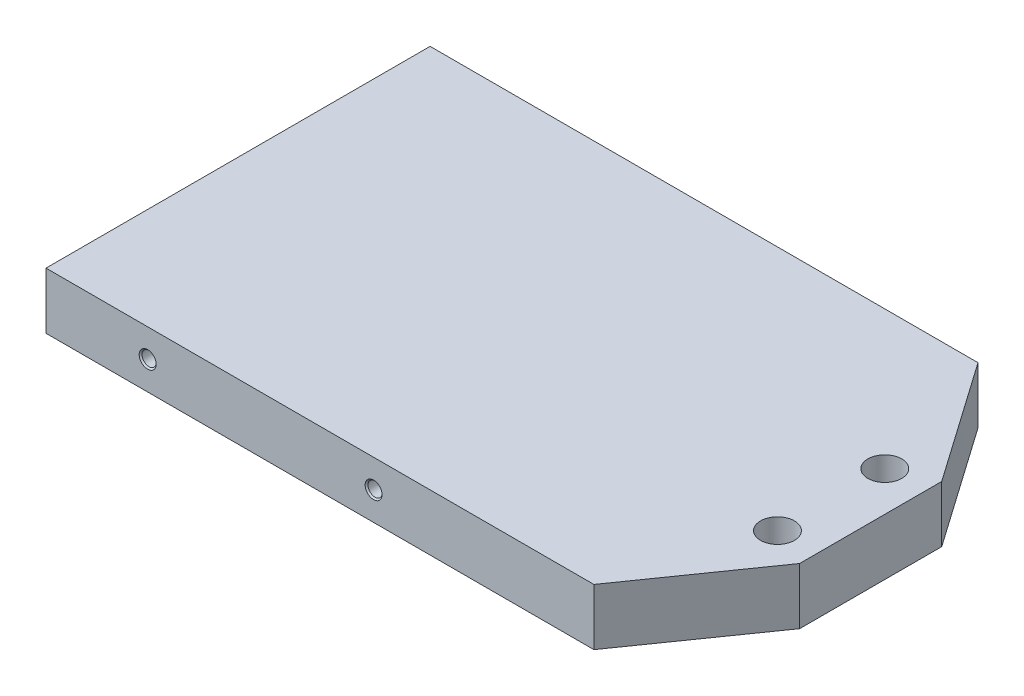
ISO-10303-21;
HEADER;
FILE_DESCRIPTION(('STEP AP214'),'2;1');
FILE_NAME('part.step','',(''),(''),'','','');
FILE_SCHEMA(('AUTOMOTIVE_DESIGN { 1 0 10303 214 1 1 1 1 }'));
ENDSEC;
DATA;
#1=APPLICATION_CONTEXT('core data for automotive mechanical design processes');
#2=APPLICATION_PROTOCOL_DEFINITION('international standard','automotive_design',2000,#1);
#3=PRODUCT_CONTEXT('',#1,'mechanical');
#4=PRODUCT('Part','Part','',(#3));
#5=PRODUCT_RELATED_PRODUCT_CATEGORY('part','',(#4));
#6=PRODUCT_DEFINITION_FORMATION('','',#4);
#7=PRODUCT_DEFINITION_CONTEXT('part definition',#1,'design');
#8=PRODUCT_DEFINITION('design','',#6,#7);
#9=PRODUCT_DEFINITION_SHAPE('','',#8);
#10=(LENGTH_UNIT() NAMED_UNIT(*) SI_UNIT(.MILLI.,.METRE.));
#11=(NAMED_UNIT(*) PLANE_ANGLE_UNIT() SI_UNIT($,.RADIAN.));
#12=(NAMED_UNIT(*) SI_UNIT($,.STERADIAN.) SOLID_ANGLE_UNIT());
#13=UNCERTAINTY_MEASURE_WITH_UNIT(LENGTH_MEASURE(1.E-05),#10,'distance_accuracy_value','');
#14=(GEOMETRIC_REPRESENTATION_CONTEXT(3) GLOBAL_UNCERTAINTY_ASSIGNED_CONTEXT((#13)) GLOBAL_UNIT_ASSIGNED_CONTEXT((#10,
#11,#12)) REPRESENTATION_CONTEXT('',''));
#15=CARTESIAN_POINT('',(0.,0.,0.));
#16=DIRECTION('',(0.,0.,1.));
#17=DIRECTION('',(1.,0.,0.));
#18=AXIS2_PLACEMENT_3D('',#15,#16,#17);
#19=CARTESIAN_POINT('',(0.,-5.,34.));
#20=DIRECTION('',(0.,1.,0.));
#21=DIRECTION('',(-1.,0.,0.));
#22=AXIS2_PLACEMENT_3D('',#19,#20,#21);
#23=PLANE('',#22);
#24=CARTESIAN_POINT('',(105.,-4.99999999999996,-9.5));
#25=DIRECTION('',(0.,-1.,0.));
#26=DIRECTION('',(0.,0.,-1.));
#27=AXIS2_PLACEMENT_3D('',#24,#25,#26);
#28=CIRCLE('',#27,6.00000000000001);
#29=CARTESIAN_POINT('',(105.,-4.99999999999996,-15.5));
#30=VERTEX_POINT('',#29);
#31=EDGE_CURVE('E197',#30,#30,#28,.T.);
#32=ORIENTED_EDGE('',*,*,#31,.F.);
#33=EDGE_LOOP('',(#32));
#34=FACE_BOUND('',#33,.T.);
#35=CARTESIAN_POINT('',(105.,-4.99999999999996,9.5));
#36=DIRECTION('',(0.,-1.,0.));
#37=DIRECTION('',(0.,0.,-1.));
#38=AXIS2_PLACEMENT_3D('',#35,#36,#37);
#39=CIRCLE('',#38,6.00000000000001);
#40=CARTESIAN_POINT('',(105.,-4.99999999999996,3.49999999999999));
#41=VERTEX_POINT('',#40);
#42=EDGE_CURVE('E182',#41,#41,#39,.T.);
#43=ORIENTED_EDGE('',*,*,#42,.F.);
#44=EDGE_LOOP('',(#43));
#45=FACE_BOUND('',#44,.T.);
#46=DIRECTION('',(0.57357643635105,0.,-0.819152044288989));
#47=VECTOR('',#46,1.);
#48=CARTESIAN_POINT('',(65.0879769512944,-4.99999999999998,79.5750921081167));
#49=LINE('',#48,#47);
#50=CARTESIAN_POINT('',(97.,-5.,34.));
#51=VERTEX_POINT('',#50);
#52=CARTESIAN_POINT('',(112.,-4.99999999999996,12.5777798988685));
#53=VERTEX_POINT('',#52);
#54=EDGE_CURVE('E158',#51,#53,#49,.T.);
#55=ORIENTED_EDGE('',*,*,#54,.F.);
#56=DIRECTION('',(1.,0.,0.));
#57=VECTOR('',#56,1.);
#58=CARTESIAN_POINT('',(0.,-5.,34.));
#59=LINE('',#58,#57);
#60=CARTESIAN_POINT('',(0.,-5.,34.));
#61=VERTEX_POINT('',#60);
#62=EDGE_CURVE('E247',#61,#51,#59,.T.);
#63=ORIENTED_EDGE('',*,*,#62,.F.);
#64=DIRECTION('',(0.,0.,-1.));
#65=VECTOR('',#64,1.);
#66=CARTESIAN_POINT('',(0.,-5.,34.));
#67=LINE('',#66,#65);
#68=CARTESIAN_POINT('',(0.,-5.,-34.));
#69=VERTEX_POINT('',#68);
#70=EDGE_CURVE('E258',#61,#69,#67,.T.);
#71=ORIENTED_EDGE('',*,*,#70,.T.);
#72=DIRECTION('',(1.,0.,0.));
#73=VECTOR('',#72,1.);
#74=CARTESIAN_POINT('',(0.,-5.,-34.));
#75=LINE('',#74,#73);
#76=CARTESIAN_POINT('',(97.,-4.99999999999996,-34.));
#77=VERTEX_POINT('',#76);
#78=EDGE_CURVE('E239',#69,#77,#75,.T.);
#79=ORIENTED_EDGE('',*,*,#78,.T.);
#80=DIRECTION('',(0.57357643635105,0.,0.819152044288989));
#81=VECTOR('',#80,1.);
#82=CARTESIAN_POINT('',(97.0375260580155,-4.99999999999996,-33.9464072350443));
#83=LINE('',#82,#81);
#84=CARTESIAN_POINT('',(112.,-4.99999999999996,-12.5777798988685));
#85=VERTEX_POINT('',#84);
#86=EDGE_CURVE('E167',#77,#85,#83,.T.);
#87=ORIENTED_EDGE('',*,*,#86,.T.);
#88=DIRECTION('',(0.,0.,-1.));
#89=VECTOR('',#88,1.);
#90=CARTESIAN_POINT('',(112.,-4.99999999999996,34.));
#91=LINE('',#90,#89);
#92=EDGE_CURVE('E256',#53,#85,#91,.T.);
#93=ORIENTED_EDGE('',*,*,#92,.F.);
#94=EDGE_LOOP('',(#55,#63,#71,#79,#87,#93));
#95=FACE_BOUND('',#94,.T.);
#96=ADVANCED_FACE('F35',(#34,#45,#95),#23,.F.);
#97=CARTESIAN_POINT('',(112.,-4.99999999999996,34.));
#98=DIRECTION('',(-1.,0.,0.));
#99=DIRECTION('',(0.,0.,1.));
#100=AXIS2_PLACEMENT_3D('',#97,#98,#99);
#101=PLANE('',#100);
#102=DIRECTION('',(0.,1.,0.));
#103=VECTOR('',#102,1.);
#104=CARTESIAN_POINT('',(112.,-169.259702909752,12.5777798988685));
#105=LINE('',#104,#103);
#106=CARTESIAN_POINT('',(112.,5.,12.5777798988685));
#107=VERTEX_POINT('',#106);
#108=EDGE_CURVE('E50',#53,#107,#105,.T.);
#109=ORIENTED_EDGE('',*,*,#108,.F.);
#110=ORIENTED_EDGE('',*,*,#92,.T.);
#111=DIRECTION('',(0.,1.,0.));
#112=VECTOR('',#111,1.);
#113=CARTESIAN_POINT('',(112.,-169.259702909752,-12.5777798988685));
#114=LINE('',#113,#112);
#115=CARTESIAN_POINT('',(112.,5.,-12.5777798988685));
#116=VERTEX_POINT('',#115);
#117=EDGE_CURVE('E161',#85,#116,#114,.T.);
#118=ORIENTED_EDGE('',*,*,#117,.T.);
#119=DIRECTION('',(0.,0.,-1.));
#120=VECTOR('',#119,1.);
#121=CARTESIAN_POINT('',(112.,5.,34.));
#122=LINE('',#121,#120);
#123=EDGE_CURVE('E254',#107,#116,#122,.T.);
#124=ORIENTED_EDGE('',*,*,#123,.F.);
#125=EDGE_LOOP('',(#109,#110,#118,#124));
#126=FACE_BOUND('',#125,.T.);
#127=ADVANCED_FACE('F276',(#126),#101,.F.);
#128=CARTESIAN_POINT('',(0.,5.,34.));
#129=DIRECTION('',(0.,-1.,0.));
#130=DIRECTION('',(0.,0.,-1.));
#131=AXIS2_PLACEMENT_3D('',#128,#129,#130);
#132=PLANE('',#131);
#133=CARTESIAN_POINT('',(105.,5.00000000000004,-9.5));
#134=DIRECTION('',(0.,-1.,0.));
#135=DIRECTION('',(0.,0.,-1.));
#136=AXIS2_PLACEMENT_3D('',#133,#134,#135);
#137=CIRCLE('',#136,3.);
#138=CARTESIAN_POINT('',(105.,5.00000000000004,-12.5));
#139=VERTEX_POINT('',#138);
#140=EDGE_CURVE('E185',#139,#139,#137,.T.);
#141=ORIENTED_EDGE('',*,*,#140,.T.);
#142=EDGE_LOOP('',(#141));
#143=FACE_BOUND('',#142,.T.);
#144=CARTESIAN_POINT('',(105.,5.00000000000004,9.5));
#145=DIRECTION('',(0.,-1.,0.));
#146=DIRECTION('',(0.,0.,-1.));
#147=AXIS2_PLACEMENT_3D('',#144,#145,#146);
#148=CIRCLE('',#147,3.);
#149=CARTESIAN_POINT('',(105.,5.00000000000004,6.5));
#150=VERTEX_POINT('',#149);
#151=EDGE_CURVE('E170',#150,#150,#148,.T.);
#152=ORIENTED_EDGE('',*,*,#151,.T.);
#153=EDGE_LOOP('',(#152));
#154=FACE_BOUND('',#153,.T.);
#155=DIRECTION('',(-0.57357643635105,0.,0.819152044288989));
#156=VECTOR('',#155,1.);
#157=CARTESIAN_POINT('',(65.0879769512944,5.,79.5750921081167));
#158=LINE('',#157,#156);
#159=CARTESIAN_POINT('',(97.,5.,34.));
#160=VERTEX_POINT('',#159);
#161=EDGE_CURVE('E58',#107,#160,#158,.T.);
#162=ORIENTED_EDGE('',*,*,#161,.F.);
#163=ORIENTED_EDGE('',*,*,#123,.T.);
#164=DIRECTION('',(-0.57357643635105,0.,-0.819152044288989));
#165=VECTOR('',#164,1.);
#166=CARTESIAN_POINT('',(97.0375260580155,5.,-33.9464072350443));
#167=LINE('',#166,#165);
#168=CARTESIAN_POINT('',(97.,5.,-34.));
#169=VERTEX_POINT('',#168);
#170=EDGE_CURVE('E164',#116,#169,#167,.T.);
#171=ORIENTED_EDGE('',*,*,#170,.T.);
#172=DIRECTION('',(-1.,0.,0.));
#173=VECTOR('',#172,1.);
#174=CARTESIAN_POINT('',(0.,5.,-34.));
#175=LINE('',#174,#173);
#176=CARTESIAN_POINT('',(0.,5.,-34.));
#177=VERTEX_POINT('',#176);
#178=EDGE_CURVE('E242',#169,#177,#175,.T.);
#179=ORIENTED_EDGE('',*,*,#178,.T.);
#180=DIRECTION('',(0.,0.,-1.));
#181=VECTOR('',#180,1.);
#182=CARTESIAN_POINT('',(0.,5.,34.));
#183=LINE('',#182,#181);
#184=CARTESIAN_POINT('',(0.,5.,34.));
#185=VERTEX_POINT('',#184);
#186=EDGE_CURVE('E251',#185,#177,#183,.T.);
#187=ORIENTED_EDGE('',*,*,#186,.F.);
#188=DIRECTION('',(-1.,0.,0.));
#189=VECTOR('',#188,1.);
#190=CARTESIAN_POINT('',(0.,5.,34.));
#191=LINE('',#190,#189);
#192=EDGE_CURVE('E249',#160,#185,#191,.T.);
#193=ORIENTED_EDGE('',*,*,#192,.F.);
#194=EDGE_LOOP('',(#162,#163,#171,#179,#187,#193));
#195=FACE_BOUND('',#194,.T.);
#196=ADVANCED_FACE('F275',(#143,#154,#195),#132,.F.);
#197=CARTESIAN_POINT('',(0.,5.,34.));
#198=DIRECTION('',(0.,0.,-1.));
#199=DIRECTION('',(-1.,0.,0.));
#200=AXIS2_PLACEMENT_3D('',#197,#198,#199);
#201=PLANE('',#200);
#202=CARTESIAN_POINT('',(58.,0.,34.));
#203=DIRECTION('',(0.,0.,1.));
#204=DIRECTION('',(1.,0.,0.));
#205=AXIS2_PLACEMENT_3D('',#202,#203,#204);
#206=CIRCLE('',#205,1.5);
#207=CARTESIAN_POINT('',(59.5,0.,34.));
#208=VERTEX_POINT('',#207);
#209=EDGE_CURVE('E138',#208,#208,#206,.T.);
#210=ORIENTED_EDGE('',*,*,#209,.F.);
#211=EDGE_LOOP('',(#210));
#212=FACE_BOUND('',#211,.T.);
#213=CARTESIAN_POINT('',(18.,0.,34.));
#214=DIRECTION('',(0.,0.,1.));
#215=DIRECTION('',(1.,0.,0.));
#216=AXIS2_PLACEMENT_3D('',#213,#214,#215);
#217=CIRCLE('',#216,1.5);
#218=CARTESIAN_POINT('',(19.5,0.,34.));
#219=VERTEX_POINT('',#218);
#220=EDGE_CURVE('E153',#219,#219,#217,.T.);
#221=ORIENTED_EDGE('',*,*,#220,.F.);
#222=EDGE_LOOP('',(#221));
#223=FACE_BOUND('',#222,.T.);
#224=DIRECTION('',(0.,-1.,0.));
#225=VECTOR('',#224,1.);
#226=CARTESIAN_POINT('',(97.,5.00000000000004,34.));
#227=LINE('',#226,#225);
#228=EDGE_CURVE('E11',#160,#51,#227,.T.);
#229=ORIENTED_EDGE('',*,*,#228,.F.);
#230=ORIENTED_EDGE('',*,*,#192,.T.);
#231=DIRECTION('',(0.,-1.,0.));
#232=VECTOR('',#231,1.);
#233=CARTESIAN_POINT('',(0.,-5.,34.));
#234=LINE('',#233,#232);
#235=EDGE_CURVE('E244',#185,#61,#234,.T.);
#236=ORIENTED_EDGE('',*,*,#235,.T.);
#237=ORIENTED_EDGE('',*,*,#62,.T.);
#238=EDGE_LOOP('',(#229,#230,#236,#237));
#239=FACE_BOUND('',#238,.T.);
#240=ADVANCED_FACE('F280',(#212,#223,#239),#201,.F.);
#241=CARTESIAN_POINT('',(0.,-5.,34.));
#242=DIRECTION('',(1.,0.,0.));
#243=DIRECTION('',(0.,1.,0.));
#244=AXIS2_PLACEMENT_3D('',#241,#242,#243);
#245=PLANE('',#244);
#246=CARTESIAN_POINT('',(0.,0.,22.5));
#247=DIRECTION('',(-1.,0.,0.));
#248=DIRECTION('',(0.,0.,1.));
#249=AXIS2_PLACEMENT_3D('',#246,#247,#248);
#250=CIRCLE('',#249,3.);
#251=CARTESIAN_POINT('',(0.,0.,25.5));
#252=VERTEX_POINT('',#251);
#253=EDGE_CURVE('E200',#252,#252,#250,.T.);
#254=ORIENTED_EDGE('',*,*,#253,.F.);
#255=EDGE_LOOP('',(#254));
#256=FACE_BOUND('',#255,.T.);
#257=CARTESIAN_POINT('',(0.,0.,-22.5));
#258=DIRECTION('',(-1.,0.,0.));
#259=DIRECTION('',(0.,0.,1.));
#260=AXIS2_PLACEMENT_3D('',#257,#258,#259);
#261=CIRCLE('',#260,3.);
#262=CARTESIAN_POINT('',(0.,0.,-19.5));
#263=VERTEX_POINT('',#262);
#264=EDGE_CURVE('E215',#263,#263,#261,.T.);
#265=ORIENTED_EDGE('',*,*,#264,.F.);
#266=EDGE_LOOP('',(#265));
#267=FACE_BOUND('',#266,.T.);
#268=CARTESIAN_POINT('',(0.,0.,29.));
#269=DIRECTION('',(-1.,0.,0.));
#270=DIRECTION('',(0.,0.,1.));
#271=AXIS2_PLACEMENT_3D('',#268,#269,#270);
#272=CIRCLE('',#271,2.5);
#273=CARTESIAN_POINT('',(0.,0.,31.5));
#274=VERTEX_POINT('',#273);
#275=EDGE_CURVE('E218',#274,#274,#272,.T.);
#276=ORIENTED_EDGE('',*,*,#275,.F.);
#277=EDGE_LOOP('',(#276));
#278=FACE_BOUND('',#277,.T.);
#279=CARTESIAN_POINT('',(0.,0.,-29.));
#280=DIRECTION('',(-1.,0.,0.));
#281=DIRECTION('',(0.,0.,1.));
#282=AXIS2_PLACEMENT_3D('',#279,#280,#281);
#283=CIRCLE('',#282,2.5);
#284=CARTESIAN_POINT('',(0.,0.,-26.5));
#285=VERTEX_POINT('',#284);
#286=EDGE_CURVE('E233',#285,#285,#283,.T.);
#287=ORIENTED_EDGE('',*,*,#286,.F.);
#288=EDGE_LOOP('',(#287));
#289=FACE_BOUND('',#288,.T.);
#290=DIRECTION('',(0.,-1.,0.));
#291=VECTOR('',#290,1.);
#292=CARTESIAN_POINT('',(0.,-5.,-34.));
#293=LINE('',#292,#291);
#294=EDGE_CURVE('E236',#177,#69,#293,.T.);
#295=ORIENTED_EDGE('',*,*,#294,.T.);
#296=ORIENTED_EDGE('',*,*,#70,.F.);
#297=ORIENTED_EDGE('',*,*,#235,.F.);
#298=ORIENTED_EDGE('',*,*,#186,.T.);
#299=EDGE_LOOP('',(#295,#296,#297,#298));
#300=FACE_BOUND('',#299,.T.);
#301=ADVANCED_FACE('F37',(#256,#267,#278,#289,#300),#245,.F.);
#302=CARTESIAN_POINT('',(0.,5.,-34.));
#303=DIRECTION('',(0.,0.,-1.));
#304=DIRECTION('',(-1.,0.,0.));
#305=AXIS2_PLACEMENT_3D('',#302,#303,#304);
#306=PLANE('',#305);
#307=CARTESIAN_POINT('',(58.,0.,-34.));
#308=DIRECTION('',(0.,0.,-1.));
#309=DIRECTION('',(-1.,0.,0.));
#310=AXIS2_PLACEMENT_3D('',#307,#308,#309);
#311=CIRCLE('',#310,1.5);
#312=CARTESIAN_POINT('',(56.5,0.,-34.));
#313=VERTEX_POINT('',#312);
#314=EDGE_CURVE('E122',#313,#313,#311,.T.);
#315=ORIENTED_EDGE('',*,*,#314,.F.);
#316=EDGE_LOOP('',(#315));
#317=FACE_BOUND('',#316,.T.);
#318=CARTESIAN_POINT('',(18.,0.,-34.));
#319=DIRECTION('',(0.,0.,-1.));
#320=DIRECTION('',(-1.,0.,0.));
#321=AXIS2_PLACEMENT_3D('',#318,#319,#320);
#322=CIRCLE('',#321,1.5);
#323=CARTESIAN_POINT('',(16.5,0.,-34.));
#324=VERTEX_POINT('',#323);
#325=EDGE_CURVE('E135',#324,#324,#322,.T.);
#326=ORIENTED_EDGE('',*,*,#325,.F.);
#327=EDGE_LOOP('',(#326));
#328=FACE_BOUND('',#327,.T.);
#329=DIRECTION('',(0.,1.,0.));
#330=VECTOR('',#329,1.);
#331=CARTESIAN_POINT('',(97.,5.00000000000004,-34.));
#332=LINE('',#331,#330);
#333=EDGE_CURVE('E43',#77,#169,#332,.T.);
#334=ORIENTED_EDGE('',*,*,#333,.F.);
#335=ORIENTED_EDGE('',*,*,#78,.F.);
#336=ORIENTED_EDGE('',*,*,#294,.F.);
#337=ORIENTED_EDGE('',*,*,#178,.F.);
#338=EDGE_LOOP('',(#334,#335,#336,#337));
#339=FACE_BOUND('',#338,.T.);
#340=ADVANCED_FACE('F267',(#317,#328,#339),#306,.T.);
#341=CARTESIAN_POINT('',(0.,0.,-29.));
#342=DIRECTION('',(-1.,0.,0.));
#343=DIRECTION('',(0.,0.,1.));
#344=AXIS2_PLACEMENT_3D('',#341,#342,#343);
#345=CONICAL_SURFACE('',#344,2.5,0.785398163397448);
#346=CARTESIAN_POINT('',(0.400000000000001,0.,-29.));
#347=DIRECTION('',(-1.,0.,0.));
#348=DIRECTION('',(0.,0.,1.));
#349=AXIS2_PLACEMENT_3D('',#346,#347,#348);
#350=CIRCLE('',#349,2.1);
#351=CARTESIAN_POINT('',(0.400000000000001,0.,-26.9));
#352=VERTEX_POINT('',#351);
#353=EDGE_CURVE('E230',#352,#352,#350,.T.);
#354=ORIENTED_EDGE('',*,*,#353,.F.);
#355=EDGE_LOOP('',(#354));
#356=FACE_BOUND('',#355,.T.);
#357=ORIENTED_EDGE('',*,*,#286,.T.);
#358=EDGE_LOOP('',(#357));
#359=FACE_BOUND('',#358,.T.);
#360=ADVANCED_FACE('F377',(#356,#359),#345,.F.);
#361=CARTESIAN_POINT('',(0.,0.,-29.));
#362=DIRECTION('',(-1.,0.,0.));
#363=DIRECTION('',(0.,0.,1.));
#364=AXIS2_PLACEMENT_3D('',#361,#362,#363);
#365=CYLINDRICAL_SURFACE('',#364,2.1);
#366=CARTESIAN_POINT('',(15.,0.,-29.));
#367=DIRECTION('',(-1.,0.,0.));
#368=DIRECTION('',(0.,0.,1.));
#369=AXIS2_PLACEMENT_3D('',#366,#367,#368);
#370=CIRCLE('',#369,2.1);
#371=CARTESIAN_POINT('',(15.,0.,-26.9));
#372=VERTEX_POINT('',#371);
#373=EDGE_CURVE('E227',#372,#372,#370,.T.);
#374=ORIENTED_EDGE('',*,*,#373,.F.);
#375=EDGE_LOOP('',(#374));
#376=FACE_BOUND('',#375,.T.);
#377=ORIENTED_EDGE('',*,*,#353,.T.);
#378=EDGE_LOOP('',(#377));
#379=FACE_BOUND('',#378,.T.);
#380=ADVANCED_FACE('F373',(#376,#379),#365,.F.);
#381=CARTESIAN_POINT('',(15.,0.,-29.));
#382=DIRECTION('',(-1.,0.,0.));
#383=DIRECTION('',(0.,0.,1.));
#384=AXIS2_PLACEMENT_3D('',#381,#382,#383);
#385=CONICAL_SURFACE('',#384,2.1,1.02974425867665);
#386=CARTESIAN_POINT('',(16.2618072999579,0.,-29.));
#387=VERTEX_POINT('',#386);
#388=VERTEX_LOOP('',#387);
#389=FACE_BOUND('',#388,.T.);
#390=ORIENTED_EDGE('',*,*,#373,.T.);
#391=EDGE_LOOP('',(#390));
#392=FACE_BOUND('',#391,.T.);
#393=ADVANCED_FACE('F364',(#389,#392),#385,.F.);
#394=CARTESIAN_POINT('',(0.,0.,29.));
#395=DIRECTION('',(-1.,0.,0.));
#396=DIRECTION('',(0.,0.,1.));
#397=AXIS2_PLACEMENT_3D('',#394,#395,#396);
#398=CONICAL_SURFACE('',#397,2.5,0.785398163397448);
#399=CARTESIAN_POINT('',(0.400000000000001,0.,29.));
#400=DIRECTION('',(-1.,0.,0.));
#401=DIRECTION('',(0.,0.,1.));
#402=AXIS2_PLACEMENT_3D('',#399,#400,#401);
#403=CIRCLE('',#402,2.1);
#404=CARTESIAN_POINT('',(0.400000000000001,0.,31.1));
#405=VERTEX_POINT('',#404);
#406=EDGE_CURVE('E224',#405,#405,#403,.T.);
#407=ORIENTED_EDGE('',*,*,#406,.F.);
#408=EDGE_LOOP('',(#407));
#409=FACE_BOUND('',#408,.T.);
#410=ORIENTED_EDGE('',*,*,#275,.T.);
#411=EDGE_LOOP('',(#410));
#412=FACE_BOUND('',#411,.T.);
#413=ADVANCED_FACE('F359',(#409,#412),#398,.F.);
#414=CARTESIAN_POINT('',(0.,0.,29.));
#415=DIRECTION('',(-1.,0.,0.));
#416=DIRECTION('',(0.,0.,1.));
#417=AXIS2_PLACEMENT_3D('',#414,#415,#416);
#418=CYLINDRICAL_SURFACE('',#417,2.1);
#419=CARTESIAN_POINT('',(15.,0.,29.));
#420=DIRECTION('',(-1.,0.,0.));
#421=DIRECTION('',(0.,0.,1.));
#422=AXIS2_PLACEMENT_3D('',#419,#420,#421);
#423=CIRCLE('',#422,2.1);
#424=CARTESIAN_POINT('',(15.,0.,31.1));
#425=VERTEX_POINT('',#424);
#426=EDGE_CURVE('E221',#425,#425,#423,.T.);
#427=ORIENTED_EDGE('',*,*,#426,.F.);
#428=EDGE_LOOP('',(#427));
#429=FACE_BOUND('',#428,.T.);
#430=ORIENTED_EDGE('',*,*,#406,.T.);
#431=EDGE_LOOP('',(#430));
#432=FACE_BOUND('',#431,.T.);
#433=ADVANCED_FACE('F362',(#429,#432),#418,.F.);
#434=CARTESIAN_POINT('',(15.,0.,29.));
#435=DIRECTION('',(-1.,0.,0.));
#436=DIRECTION('',(0.,0.,1.));
#437=AXIS2_PLACEMENT_3D('',#434,#435,#436);
#438=CONICAL_SURFACE('',#437,2.1,1.02974425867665);
#439=CARTESIAN_POINT('',(16.2618072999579,0.,29.));
#440=VERTEX_POINT('',#439);
#441=VERTEX_LOOP('',#440);
#442=FACE_BOUND('',#441,.T.);
#443=ORIENTED_EDGE('',*,*,#426,.T.);
#444=EDGE_LOOP('',(#443));
#445=FACE_BOUND('',#444,.T.);
#446=ADVANCED_FACE('F357',(#442,#445),#438,.F.);
#447=CARTESIAN_POINT('',(0.,0.,-22.5));
#448=DIRECTION('',(-1.,0.,0.));
#449=DIRECTION('',(0.,0.,1.));
#450=AXIS2_PLACEMENT_3D('',#447,#448,#449);
#451=CONICAL_SURFACE('',#450,3.,0.785398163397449);
#452=CARTESIAN_POINT('',(0.5,0.,-22.5));
#453=DIRECTION('',(-1.,0.,0.));
#454=DIRECTION('',(0.,0.,1.));
#455=AXIS2_PLACEMENT_3D('',#452,#453,#454);
#456=CIRCLE('',#455,2.5);
#457=CARTESIAN_POINT('',(0.5,0.,-20.));
#458=VERTEX_POINT('',#457);
#459=EDGE_CURVE('E212',#458,#458,#456,.T.);
#460=ORIENTED_EDGE('',*,*,#459,.F.);
#461=EDGE_LOOP('',(#460));
#462=FACE_BOUND('',#461,.T.);
#463=ORIENTED_EDGE('',*,*,#264,.T.);
#464=EDGE_LOOP('',(#463));
#465=FACE_BOUND('',#464,.T.);
#466=ADVANCED_FACE('F353',(#462,#465),#451,.F.);
#467=CARTESIAN_POINT('',(0.,0.,-22.5));
#468=DIRECTION('',(-1.,0.,0.));
#469=DIRECTION('',(0.,0.,1.));
#470=AXIS2_PLACEMENT_3D('',#467,#468,#469);
#471=CYLINDRICAL_SURFACE('',#470,2.5);
#472=CARTESIAN_POINT('',(12.,0.,-22.5));
#473=DIRECTION('',(-1.,0.,0.));
#474=DIRECTION('',(0.,0.,1.));
#475=AXIS2_PLACEMENT_3D('',#472,#473,#474);
#476=CIRCLE('',#475,2.5);
#477=CARTESIAN_POINT('',(12.,0.,-20.));
#478=VERTEX_POINT('',#477);
#479=EDGE_CURVE('E209',#478,#478,#476,.T.);
#480=ORIENTED_EDGE('',*,*,#479,.F.);
#481=EDGE_LOOP('',(#480));
#482=FACE_BOUND('',#481,.T.);
#483=ORIENTED_EDGE('',*,*,#459,.T.);
#484=EDGE_LOOP('',(#483));
#485=FACE_BOUND('',#484,.T.);
#486=ADVANCED_FACE('F349',(#482,#485),#471,.F.);
#487=CARTESIAN_POINT('',(12.,0.,-22.5));
#488=DIRECTION('',(-1.,0.,0.));
#489=DIRECTION('',(0.,0.,1.));
#490=AXIS2_PLACEMENT_3D('',#487,#488,#489);
#491=CONICAL_SURFACE('',#490,2.5,1.02974425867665);
#492=CARTESIAN_POINT('',(13.5021515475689,0.,-22.5));
#493=VERTEX_POINT('',#492);
#494=VERTEX_LOOP('',#493);
#495=FACE_BOUND('',#494,.T.);
#496=ORIENTED_EDGE('',*,*,#479,.T.);
#497=EDGE_LOOP('',(#496));
#498=FACE_BOUND('',#497,.T.);
#499=ADVANCED_FACE('F340',(#495,#498),#491,.F.);
#500=CARTESIAN_POINT('',(0.,0.,22.5));
#501=DIRECTION('',(-1.,0.,0.));
#502=DIRECTION('',(0.,0.,1.));
#503=AXIS2_PLACEMENT_3D('',#500,#501,#502);
#504=CONICAL_SURFACE('',#503,3.,0.785398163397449);
#505=CARTESIAN_POINT('',(0.5,0.,22.5));
#506=DIRECTION('',(-1.,0.,0.));
#507=DIRECTION('',(0.,0.,1.));
#508=AXIS2_PLACEMENT_3D('',#505,#506,#507);
#509=CIRCLE('',#508,2.5);
#510=CARTESIAN_POINT('',(0.5,0.,25.));
#511=VERTEX_POINT('',#510);
#512=EDGE_CURVE('E206',#511,#511,#509,.T.);
#513=ORIENTED_EDGE('',*,*,#512,.F.);
#514=EDGE_LOOP('',(#513));
#515=FACE_BOUND('',#514,.T.);
#516=ORIENTED_EDGE('',*,*,#253,.T.);
#517=EDGE_LOOP('',(#516));
#518=FACE_BOUND('',#517,.T.);
#519=ADVANCED_FACE('F335',(#515,#518),#504,.F.);
#520=CARTESIAN_POINT('',(0.,0.,22.5));
#521=DIRECTION('',(-1.,0.,0.));
#522=DIRECTION('',(0.,0.,1.));
#523=AXIS2_PLACEMENT_3D('',#520,#521,#522);
#524=CYLINDRICAL_SURFACE('',#523,2.5);
#525=CARTESIAN_POINT('',(12.,0.,22.5));
#526=DIRECTION('',(-1.,0.,0.));
#527=DIRECTION('',(0.,0.,1.));
#528=AXIS2_PLACEMENT_3D('',#525,#526,#527);
#529=CIRCLE('',#528,2.5);
#530=CARTESIAN_POINT('',(12.,0.,25.));
#531=VERTEX_POINT('',#530);
#532=EDGE_CURVE('E203',#531,#531,#529,.T.);
#533=ORIENTED_EDGE('',*,*,#532,.F.);
#534=EDGE_LOOP('',(#533));
#535=FACE_BOUND('',#534,.T.);
#536=ORIENTED_EDGE('',*,*,#512,.T.);
#537=EDGE_LOOP('',(#536));
#538=FACE_BOUND('',#537,.T.);
#539=ADVANCED_FACE('F338',(#535,#538),#524,.F.);
#540=CARTESIAN_POINT('',(12.,0.,22.5));
#541=DIRECTION('',(-1.,0.,0.));
#542=DIRECTION('',(0.,0.,1.));
#543=AXIS2_PLACEMENT_3D('',#540,#541,#542);
#544=CONICAL_SURFACE('',#543,2.5,1.02974425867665);
#545=CARTESIAN_POINT('',(13.5021515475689,0.,22.5));
#546=VERTEX_POINT('',#545);
#547=VERTEX_LOOP('',#546);
#548=FACE_BOUND('',#547,.T.);
#549=ORIENTED_EDGE('',*,*,#532,.T.);
#550=EDGE_LOOP('',(#549));
#551=FACE_BOUND('',#550,.T.);
#552=ADVANCED_FACE('F333',(#548,#551),#544,.F.);
#553=CARTESIAN_POINT('',(105.,-4.99999999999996,-9.5));
#554=DIRECTION('',(0.,-1.,0.));
#555=DIRECTION('',(0.,0.,-1.));
#556=AXIS2_PLACEMENT_3D('',#553,#554,#555);
#557=CONICAL_SURFACE('',#556,6.00000000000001,0.78539816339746);
#558=CARTESIAN_POINT('',(105.,-4.49999999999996,-9.5));
#559=DIRECTION('',(0.,-1.,0.));
#560=DIRECTION('',(0.,0.,-1.));
#561=AXIS2_PLACEMENT_3D('',#558,#559,#560);
#562=CIRCLE('',#561,5.49999999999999);
#563=CARTESIAN_POINT('',(105.,-4.49999999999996,-15.));
#564=VERTEX_POINT('',#563);
#565=EDGE_CURVE('E194',#564,#564,#562,.T.);
#566=ORIENTED_EDGE('',*,*,#565,.F.);
#567=EDGE_LOOP('',(#566));
#568=FACE_BOUND('',#567,.T.);
#569=ORIENTED_EDGE('',*,*,#31,.T.);
#570=EDGE_LOOP('',(#569));
#571=FACE_BOUND('',#570,.T.);
#572=ADVANCED_FACE('F329',(#568,#571),#557,.F.);
#573=CARTESIAN_POINT('',(105.,-4.99999999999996,-9.5));
#574=DIRECTION('',(0.,-1.,0.));
#575=DIRECTION('',(0.,0.,-1.));
#576=AXIS2_PLACEMENT_3D('',#573,#574,#575);
#577=CYLINDRICAL_SURFACE('',#576,5.5);
#578=CARTESIAN_POINT('',(105.,0.200000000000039,-9.5));
#579=DIRECTION('',(0.,-1.,0.));
#580=DIRECTION('',(0.,0.,-1.));
#581=AXIS2_PLACEMENT_3D('',#578,#579,#580);
#582=CIRCLE('',#581,5.50000000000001);
#583=CARTESIAN_POINT('',(105.,0.200000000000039,-15.));
#584=VERTEX_POINT('',#583);
#585=EDGE_CURVE('E191',#584,#584,#582,.T.);
#586=ORIENTED_EDGE('',*,*,#585,.F.);
#587=EDGE_LOOP('',(#586));
#588=FACE_BOUND('',#587,.T.);
#589=ORIENTED_EDGE('',*,*,#565,.T.);
#590=EDGE_LOOP('',(#589));
#591=FACE_BOUND('',#590,.T.);
#592=ADVANCED_FACE('F325',(#588,#591),#577,.F.);
#593=CARTESIAN_POINT('',(110.5,0.200000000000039,-9.5));
#594=DIRECTION('',(0.,1.,0.));
#595=DIRECTION('',(0.,0.,1.));
#596=AXIS2_PLACEMENT_3D('',#593,#594,#595);
#597=PLANE('',#596);
#598=CARTESIAN_POINT('',(105.,0.200000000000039,-9.5));
#599=DIRECTION('',(0.,-1.,0.));
#600=DIRECTION('',(0.,0.,-1.));
#601=AXIS2_PLACEMENT_3D('',#598,#599,#600);
#602=CIRCLE('',#601,3.);
#603=CARTESIAN_POINT('',(105.,0.200000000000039,-12.5));
#604=VERTEX_POINT('',#603);
#605=EDGE_CURVE('E188',#604,#604,#602,.T.);
#606=ORIENTED_EDGE('',*,*,#605,.F.);
#607=EDGE_LOOP('',(#606));
#608=FACE_BOUND('',#607,.T.);
#609=ORIENTED_EDGE('',*,*,#585,.T.);
#610=EDGE_LOOP('',(#609));
#611=FACE_BOUND('',#610,.T.);
#612=ADVANCED_FACE('F317',(#608,#611),#597,.F.);
#613=CARTESIAN_POINT('',(105.,-4.99999999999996,-9.5));
#614=DIRECTION('',(0.,-1.,0.));
#615=DIRECTION('',(0.,0.,-1.));
#616=AXIS2_PLACEMENT_3D('',#613,#614,#615);
#617=CYLINDRICAL_SURFACE('',#616,3.);
#618=ORIENTED_EDGE('',*,*,#140,.F.);
#619=EDGE_LOOP('',(#618));
#620=FACE_BOUND('',#619,.T.);
#621=ORIENTED_EDGE('',*,*,#605,.T.);
#622=EDGE_LOOP('',(#621));
#623=FACE_BOUND('',#622,.T.);
#624=ADVANCED_FACE('F307',(#620,#623),#617,.F.);
#625=CARTESIAN_POINT('',(105.,-4.99999999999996,9.5));
#626=DIRECTION('',(0.,-1.,0.));
#627=DIRECTION('',(0.,0.,-1.));
#628=AXIS2_PLACEMENT_3D('',#625,#626,#627);
#629=CONICAL_SURFACE('',#628,6.00000000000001,0.78539816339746);
#630=CARTESIAN_POINT('',(105.,-4.49999999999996,9.5));
#631=DIRECTION('',(0.,-1.,0.));
#632=DIRECTION('',(0.,0.,-1.));
#633=AXIS2_PLACEMENT_3D('',#630,#631,#632);
#634=CIRCLE('',#633,5.49999999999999);
#635=CARTESIAN_POINT('',(105.,-4.49999999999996,4.00000000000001));
#636=VERTEX_POINT('',#635);
#637=EDGE_CURVE('E179',#636,#636,#634,.T.);
#638=ORIENTED_EDGE('',*,*,#637,.F.);
#639=EDGE_LOOP('',(#638));
#640=FACE_BOUND('',#639,.T.);
#641=ORIENTED_EDGE('',*,*,#42,.T.);
#642=EDGE_LOOP('',(#641));
#643=FACE_BOUND('',#642,.T.);
#644=ADVANCED_FACE('F304',(#640,#643),#629,.F.);
#645=CARTESIAN_POINT('',(105.,-4.99999999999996,9.5));
#646=DIRECTION('',(0.,-1.,0.));
#647=DIRECTION('',(0.,0.,-1.));
#648=AXIS2_PLACEMENT_3D('',#645,#646,#647);
#649=CYLINDRICAL_SURFACE('',#648,5.5);
#650=CARTESIAN_POINT('',(105.,0.200000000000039,9.5));
#651=DIRECTION('',(0.,-1.,0.));
#652=DIRECTION('',(0.,0.,-1.));
#653=AXIS2_PLACEMENT_3D('',#650,#651,#652);
#654=CIRCLE('',#653,5.50000000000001);
#655=CARTESIAN_POINT('',(105.,0.200000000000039,3.99999999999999));
#656=VERTEX_POINT('',#655);
#657=EDGE_CURVE('E176',#656,#656,#654,.T.);
#658=ORIENTED_EDGE('',*,*,#657,.F.);
#659=EDGE_LOOP('',(#658));
#660=FACE_BOUND('',#659,.T.);
#661=ORIENTED_EDGE('',*,*,#637,.T.);
#662=EDGE_LOOP('',(#661));
#663=FACE_BOUND('',#662,.T.);
#664=ADVANCED_FACE('F306',(#660,#663),#649,.F.);
#665=CARTESIAN_POINT('',(110.5,0.200000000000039,9.5));
#666=DIRECTION('',(0.,1.,0.));
#667=DIRECTION('',(0.,0.,1.));
#668=AXIS2_PLACEMENT_3D('',#665,#666,#667);
#669=PLANE('',#668);
#670=CARTESIAN_POINT('',(105.,0.200000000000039,9.5));
#671=DIRECTION('',(0.,-1.,0.));
#672=DIRECTION('',(0.,0.,-1.));
#673=AXIS2_PLACEMENT_3D('',#670,#671,#672);
#674=CIRCLE('',#673,3.);
#675=CARTESIAN_POINT('',(105.,0.200000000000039,6.5));
#676=VERTEX_POINT('',#675);
#677=EDGE_CURVE('E173',#676,#676,#674,.T.);
#678=ORIENTED_EDGE('',*,*,#677,.F.);
#679=EDGE_LOOP('',(#678));
#680=FACE_BOUND('',#679,.T.);
#681=ORIENTED_EDGE('',*,*,#657,.T.);
#682=EDGE_LOOP('',(#681));
#683=FACE_BOUND('',#682,.T.);
#684=ADVANCED_FACE('F314',(#680,#683),#669,.F.);
#685=CARTESIAN_POINT('',(105.,-4.99999999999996,9.5));
#686=DIRECTION('',(0.,-1.,0.));
#687=DIRECTION('',(0.,0.,-1.));
#688=AXIS2_PLACEMENT_3D('',#685,#686,#687);
#689=CYLINDRICAL_SURFACE('',#688,3.);
#690=ORIENTED_EDGE('',*,*,#151,.F.);
#691=EDGE_LOOP('',(#690));
#692=FACE_BOUND('',#691,.T.);
#693=ORIENTED_EDGE('',*,*,#677,.T.);
#694=EDGE_LOOP('',(#693));
#695=FACE_BOUND('',#694,.T.);
#696=ADVANCED_FACE('F433',(#692,#695),#689,.F.);
#697=CARTESIAN_POINT('',(97.0000000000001,-169.259702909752,-34.));
#698=DIRECTION('',(-0.819152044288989,0.,0.57357643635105));
#699=DIRECTION('',(0.57357643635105,0.,0.819152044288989));
#700=AXIS2_PLACEMENT_3D('',#697,#698,#699);
#701=PLANE('',#700);
#702=ORIENTED_EDGE('',*,*,#86,.F.);
#703=ORIENTED_EDGE('',*,*,#333,.T.);
#704=ORIENTED_EDGE('',*,*,#170,.F.);
#705=ORIENTED_EDGE('',*,*,#117,.F.);
#706=EDGE_LOOP('',(#702,#703,#704,#705));
#707=FACE_BOUND('',#706,.T.);
#708=ADVANCED_FACE('F264',(#707),#701,.F.);
#709=CARTESIAN_POINT('',(97.0000000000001,-169.259702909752,34.));
#710=DIRECTION('',(0.819152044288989,0.,0.57357643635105));
#711=DIRECTION('',(0.57357643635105,0.,-0.819152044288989));
#712=AXIS2_PLACEMENT_3D('',#709,#710,#711);
#713=PLANE('',#712);
#714=ORIENTED_EDGE('',*,*,#228,.T.);
#715=ORIENTED_EDGE('',*,*,#54,.T.);
#716=ORIENTED_EDGE('',*,*,#108,.T.);
#717=ORIENTED_EDGE('',*,*,#161,.T.);
#718=EDGE_LOOP('',(#714,#715,#716,#717));
#719=FACE_BOUND('',#718,.T.);
#720=ADVANCED_FACE('F278',(#719),#713,.T.);
#721=CARTESIAN_POINT('',(18.,0.,34.));
#722=DIRECTION('',(0.,0.,1.));
#723=DIRECTION('',(1.,0.,0.));
#724=AXIS2_PLACEMENT_3D('',#721,#722,#723);
#725=CONICAL_SURFACE('',#724,1.5,0.785398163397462);
#726=CARTESIAN_POINT('',(18.,0.,33.75));
#727=DIRECTION('',(0.,0.,1.));
#728=DIRECTION('',(1.,0.,0.));
#729=AXIS2_PLACEMENT_3D('',#726,#727,#728);
#730=CIRCLE('',#729,1.24999999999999);
#731=CARTESIAN_POINT('',(19.2499999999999,0.,33.75));
#732=VERTEX_POINT('',#731);
#733=EDGE_CURVE('E150',#732,#732,#730,.T.);
#734=ORIENTED_EDGE('',*,*,#733,.F.);
#735=EDGE_LOOP('',(#734));
#736=FACE_BOUND('',#735,.T.);
#737=ORIENTED_EDGE('',*,*,#220,.T.);
#738=EDGE_LOOP('',(#737));
#739=FACE_BOUND('',#738,.T.);
#740=ADVANCED_FACE('F424',(#736,#739),#725,.F.);
#741=CARTESIAN_POINT('',(18.,0.,34.));
#742=DIRECTION('',(0.,0.,1.));
#743=DIRECTION('',(1.,0.,0.));
#744=AXIS2_PLACEMENT_3D('',#741,#742,#743);
#745=CYLINDRICAL_SURFACE('',#744,1.24999999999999);
#746=CARTESIAN_POINT('',(18.,0.,24.));
#747=DIRECTION('',(0.,0.,1.));
#748=DIRECTION('',(1.,0.,0.));
#749=AXIS2_PLACEMENT_3D('',#746,#747,#748);
#750=CIRCLE('',#749,1.24999999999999);
#751=CARTESIAN_POINT('',(19.2499999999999,0.,24.));
#752=VERTEX_POINT('',#751);
#753=EDGE_CURVE('E147',#752,#752,#750,.T.);
#754=ORIENTED_EDGE('',*,*,#753,.F.);
#755=EDGE_LOOP('',(#754));
#756=FACE_BOUND('',#755,.T.);
#757=ORIENTED_EDGE('',*,*,#733,.T.);
#758=EDGE_LOOP('',(#757));
#759=FACE_BOUND('',#758,.T.);
#760=ADVANCED_FACE('F416',(#756,#759),#745,.F.);
#761=CARTESIAN_POINT('',(18.,0.,24.));
#762=DIRECTION('',(0.,0.,1.));
#763=DIRECTION('',(1.,0.,0.));
#764=AXIS2_PLACEMENT_3D('',#761,#762,#763);
#765=CONICAL_SURFACE('',#764,1.24999999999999,1.02974425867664);
#766=CARTESIAN_POINT('',(18.,0.,23.2489242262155));
#767=VERTEX_POINT('',#766);
#768=VERTEX_LOOP('',#767);
#769=FACE_BOUND('',#768,.T.);
#770=ORIENTED_EDGE('',*,*,#753,.T.);
#771=EDGE_LOOP('',(#770));
#772=FACE_BOUND('',#771,.T.);
#773=ADVANCED_FACE('F405',(#769,#772),#765,.F.);
#774=CARTESIAN_POINT('',(58.,0.,34.));
#775=DIRECTION('',(0.,0.,1.));
#776=DIRECTION('',(1.,0.,0.));
#777=AXIS2_PLACEMENT_3D('',#774,#775,#776);
#778=CONICAL_SURFACE('',#777,1.5,0.785398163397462);
#779=CARTESIAN_POINT('',(58.,0.,33.75));
#780=DIRECTION('',(0.,0.,1.));
#781=DIRECTION('',(1.,0.,0.));
#782=AXIS2_PLACEMENT_3D('',#779,#780,#781);
#783=CIRCLE('',#782,1.24999999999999);
#784=CARTESIAN_POINT('',(59.2499999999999,0.,33.75));
#785=VERTEX_POINT('',#784);
#786=EDGE_CURVE('E144',#785,#785,#783,.T.);
#787=ORIENTED_EDGE('',*,*,#786,.F.);
#788=EDGE_LOOP('',(#787));
#789=FACE_BOUND('',#788,.T.);
#790=ORIENTED_EDGE('',*,*,#209,.T.);
#791=EDGE_LOOP('',(#790));
#792=FACE_BOUND('',#791,.T.);
#793=ADVANCED_FACE('F395',(#789,#792),#778,.F.);
#794=CARTESIAN_POINT('',(58.,0.,34.));
#795=DIRECTION('',(0.,0.,1.));
#796=DIRECTION('',(1.,0.,0.));
#797=AXIS2_PLACEMENT_3D('',#794,#795,#796);
#798=CYLINDRICAL_SURFACE('',#797,1.24999999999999);
#799=CARTESIAN_POINT('',(58.,0.,24.));
#800=DIRECTION('',(0.,0.,1.));
#801=DIRECTION('',(1.,0.,0.));
#802=AXIS2_PLACEMENT_3D('',#799,#800,#801);
#803=CIRCLE('',#802,1.24999999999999);
#804=CARTESIAN_POINT('',(59.2499999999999,0.,24.));
#805=VERTEX_POINT('',#804);
#806=EDGE_CURVE('E141',#805,#805,#803,.T.);
#807=ORIENTED_EDGE('',*,*,#806,.F.);
#808=EDGE_LOOP('',(#807));
#809=FACE_BOUND('',#808,.T.);
#810=ORIENTED_EDGE('',*,*,#786,.T.);
#811=EDGE_LOOP('',(#810));
#812=FACE_BOUND('',#811,.T.);
#813=ADVANCED_FACE('F402',(#809,#812),#798,.F.);
#814=CARTESIAN_POINT('',(58.,0.,24.));
#815=DIRECTION('',(0.,0.,1.));
#816=DIRECTION('',(1.,0.,0.));
#817=AXIS2_PLACEMENT_3D('',#814,#815,#816);
#818=CONICAL_SURFACE('',#817,1.24999999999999,1.02974425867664);
#819=CARTESIAN_POINT('',(58.,0.,23.2489242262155));
#820=VERTEX_POINT('',#819);
#821=VERTEX_LOOP('',#820);
#822=FACE_BOUND('',#821,.T.);
#823=ORIENTED_EDGE('',*,*,#806,.T.);
#824=EDGE_LOOP('',(#823));
#825=FACE_BOUND('',#824,.T.);
#826=ADVANCED_FACE('F392',(#822,#825),#818,.F.);
#827=CARTESIAN_POINT('',(18.,0.,-34.));
#828=DIRECTION('',(0.,0.,-1.));
#829=DIRECTION('',(-1.,0.,0.));
#830=AXIS2_PLACEMENT_3D('',#827,#828,#829);
#831=CONICAL_SURFACE('',#830,1.5,0.785398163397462);
#832=CARTESIAN_POINT('',(18.,0.,-33.75));
#833=DIRECTION('',(0.,0.,-1.));
#834=DIRECTION('',(-1.,0.,0.));
#835=AXIS2_PLACEMENT_3D('',#832,#833,#834);
#836=CIRCLE('',#835,1.24999999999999);
#837=CARTESIAN_POINT('',(16.75,0.,-33.75));
#838=VERTEX_POINT('',#837);
#839=EDGE_CURVE('E132',#838,#838,#836,.T.);
#840=ORIENTED_EDGE('',*,*,#839,.F.);
#841=EDGE_LOOP('',(#840));
#842=FACE_BOUND('',#841,.T.);
#843=ORIENTED_EDGE('',*,*,#325,.T.);
#844=EDGE_LOOP('',(#843));
#845=FACE_BOUND('',#844,.T.);
#846=ADVANCED_FACE('F389',(#842,#845),#831,.F.);
#847=CARTESIAN_POINT('',(18.,0.,-34.));
#848=DIRECTION('',(0.,0.,-1.));
#849=DIRECTION('',(-1.,0.,0.));
#850=AXIS2_PLACEMENT_3D('',#847,#848,#849);
#851=CYLINDRICAL_SURFACE('',#850,1.24999999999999);
#852=CARTESIAN_POINT('',(18.,0.,-24.));
#853=DIRECTION('',(0.,0.,-1.));
#854=DIRECTION('',(-1.,0.,0.));
#855=AXIS2_PLACEMENT_3D('',#852,#853,#854);
#856=CIRCLE('',#855,1.24999999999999);
#857=CARTESIAN_POINT('',(16.75,0.,-24.));
#858=VERTEX_POINT('',#857);
#859=EDGE_CURVE('E125',#858,#858,#856,.T.);
#860=ORIENTED_EDGE('',*,*,#859,.F.);
#861=EDGE_LOOP('',(#860));
#862=FACE_BOUND('',#861,.T.);
#863=ORIENTED_EDGE('',*,*,#839,.T.);
#864=EDGE_LOOP('',(#863));
#865=FACE_BOUND('',#864,.T.);
#866=ADVANCED_FACE('F391',(#862,#865),#851,.F.);
#867=CARTESIAN_POINT('',(18.,0.,-24.));
#868=DIRECTION('',(0.,0.,-1.));
#869=DIRECTION('',(-1.,0.,0.));
#870=AXIS2_PLACEMENT_3D('',#867,#868,#869);
#871=CONICAL_SURFACE('',#870,1.24999999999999,1.02974425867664);
#872=CARTESIAN_POINT('',(18.,0.,-23.2489242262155));
#873=VERTEX_POINT('',#872);
#874=VERTEX_LOOP('',#873);
#875=FACE_BOUND('',#874,.T.);
#876=ORIENTED_EDGE('',*,*,#859,.T.);
#877=EDGE_LOOP('',(#876));
#878=FACE_BOUND('',#877,.T.);
#879=ADVANCED_FACE('F116',(#875,#878),#871,.F.);
#880=CARTESIAN_POINT('',(58.,0.,-34.));
#881=DIRECTION('',(0.,0.,-1.));
#882=DIRECTION('',(-1.,0.,0.));
#883=AXIS2_PLACEMENT_3D('',#880,#881,#882);
#884=CONICAL_SURFACE('',#883,1.5,0.785398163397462);
#885=CARTESIAN_POINT('',(58.,0.,-33.75));
#886=DIRECTION('',(0.,0.,-1.));
#887=DIRECTION('',(-1.,0.,0.));
#888=AXIS2_PLACEMENT_3D('',#885,#886,#887);
#889=CIRCLE('',#888,1.24999999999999);
#890=CARTESIAN_POINT('',(56.75,0.,-33.75));
#891=VERTEX_POINT('',#890);
#892=EDGE_CURVE('E121',#891,#891,#889,.T.);
#893=ORIENTED_EDGE('',*,*,#892,.F.);
#894=EDGE_LOOP('',(#893));
#895=FACE_BOUND('',#894,.T.);
#896=ORIENTED_EDGE('',*,*,#314,.T.);
#897=EDGE_LOOP('',(#896));
#898=FACE_BOUND('',#897,.T.);
#899=ADVANCED_FACE('F515',(#895,#898),#884,.F.);
#900=CARTESIAN_POINT('',(58.,0.,-34.));
#901=DIRECTION('',(0.,0.,-1.));
#902=DIRECTION('',(-1.,0.,0.));
#903=AXIS2_PLACEMENT_3D('',#900,#901,#902);
#904=CYLINDRICAL_SURFACE('',#903,1.24999999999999);
#905=CARTESIAN_POINT('',(58.,0.,-24.));
#906=DIRECTION('',(0.,0.,-1.));
#907=DIRECTION('',(-1.,0.,0.));
#908=AXIS2_PLACEMENT_3D('',#905,#906,#907);
#909=CIRCLE('',#908,1.24999999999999);
#910=CARTESIAN_POINT('',(56.75,0.,-24.));
#911=VERTEX_POINT('',#910);
#912=EDGE_CURVE('E119',#911,#911,#909,.T.);
#913=ORIENTED_EDGE('',*,*,#912,.F.);
#914=EDGE_LOOP('',(#913));
#915=FACE_BOUND('',#914,.T.);
#916=ORIENTED_EDGE('',*,*,#892,.T.);
#917=EDGE_LOOP('',(#916));
#918=FACE_BOUND('',#917,.T.);
#919=ADVANCED_FACE('F114',(#915,#918),#904,.F.);
#920=CARTESIAN_POINT('',(58.,0.,-24.));
#921=DIRECTION('',(0.,0.,-1.));
#922=DIRECTION('',(-1.,0.,0.));
#923=AXIS2_PLACEMENT_3D('',#920,#921,#922);
#924=CONICAL_SURFACE('',#923,1.24999999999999,1.02974425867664);
#925=CARTESIAN_POINT('',(58.,0.,-23.2489242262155));
#926=VERTEX_POINT('',#925);
#927=VERTEX_LOOP('',#926);
#928=FACE_BOUND('',#927,.T.);
#929=ORIENTED_EDGE('',*,*,#912,.T.);
#930=EDGE_LOOP('',(#929));
#931=FACE_BOUND('',#930,.T.);
#932=ADVANCED_FACE('F111',(#928,#931),#924,.F.);
#933=CLOSED_SHELL('',(#96,#127,#196,#240,#301,#340,#360,#380,#393,#413,#433,#446,#466,#486,#499,
#519,#539,#552,#572,#592,#612,#624,#644,#664,#684,#696,#708,#720,#740,#760,#773,#793,#813,#826,
#846,#866,#879,#899,#919,#932));
#934=MANIFOLD_SOLID_BREP('B2',#933);
#935=ADVANCED_BREP_SHAPE_REPRESENTATION('',(#18,#934),#14);
#936=SHAPE_DEFINITION_REPRESENTATION(#9,#935);
ENDSEC;
END-ISO-10303-21;
